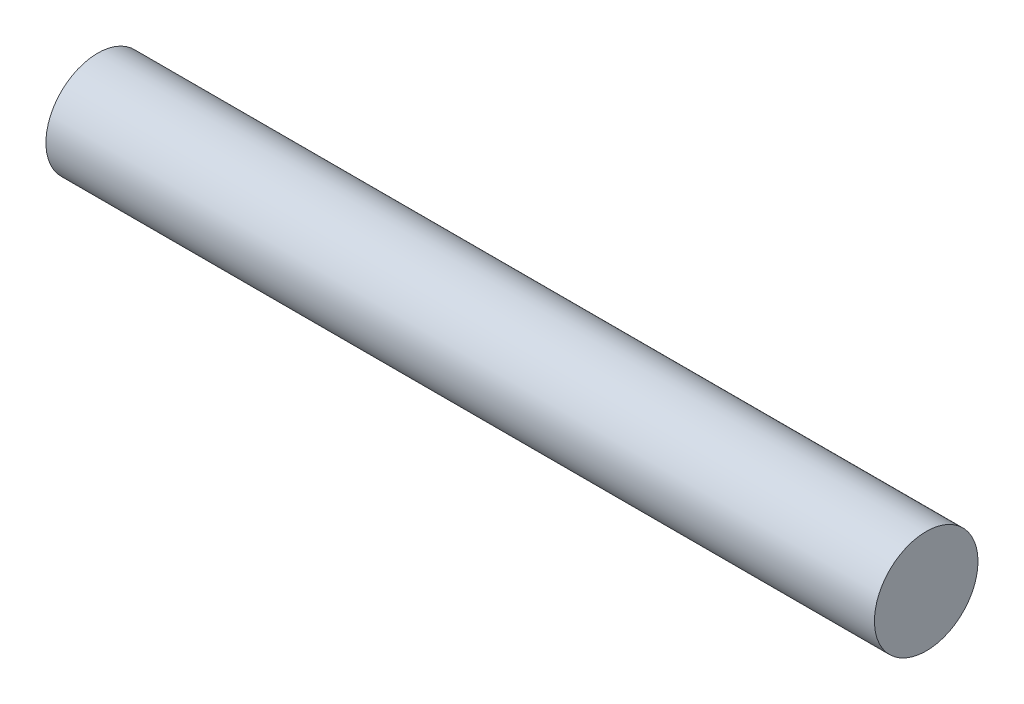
from build123d import *

# Parameters (mm, degrees)
CROQUIS1_R              = 1
SALIENTE_EXTRUIR1_DEPTH = 16


with BuildPart() as part:
    # Croquis1 → Saliente-Extruir1 (new body)
    with BuildSketch(Plane(origin=(0, 0, 0), x_dir=(0, 0, -1), z_dir=(1, 0, 0))):
        Circle(CROQUIS1_R)
    extrude(amount=SALIENTE_EXTRUIR1_DEPTH)


solid = part.part
